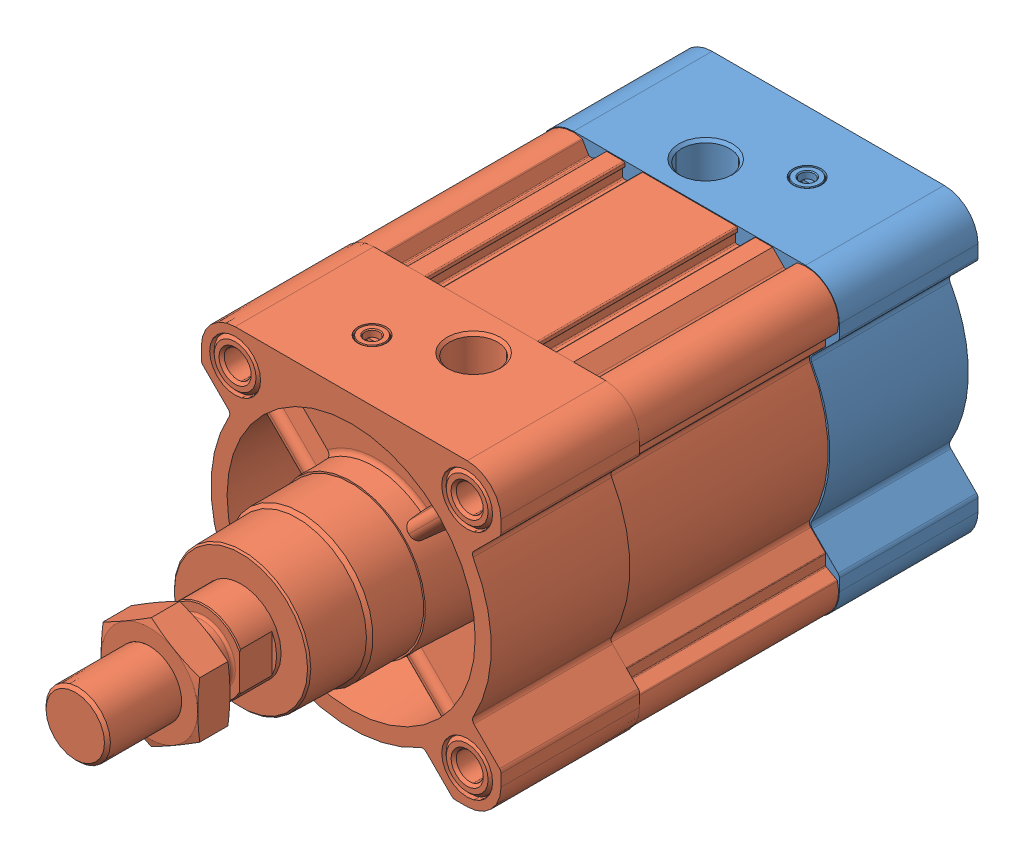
SolidWorks assembly CPME80-20.SLDASM, configuration Valor predeterminado (file format 12000). Lengths in mm.
Overall size (93 93 237.6).
2 component instances, 2 part files, 2 mates.
Components (placement in the parent):
- CPME80-20_T-1: CPME80-20_T.SLDPRT [Valor predeterminado] at (-114.8161 0.5613 158.5) size (93 93 47)
- CPME80-20-1: CPME80-20.SLDPRT [Valor predeterminado] at (-114.8161 0.5613 128.5) size (93 93 193.6)
Mates (geometry in assembly coordinates):
- Coincidente1: coincident anti-aligned: plane of CPME80-20_T-1 through (-159.8161 32.8333 23.5) normal (0 0 1); plane of CPME80-20-1 through (-114.8161 0.5613 23.5) normal (0 0 -1)
- Concêntrico1: concentric aligned: circle of CPME80-20_T-1; cylinder of CPME80-20-1 through (-114.8161 0.5613 -6.5) axis (0 0 -1) radius 40
